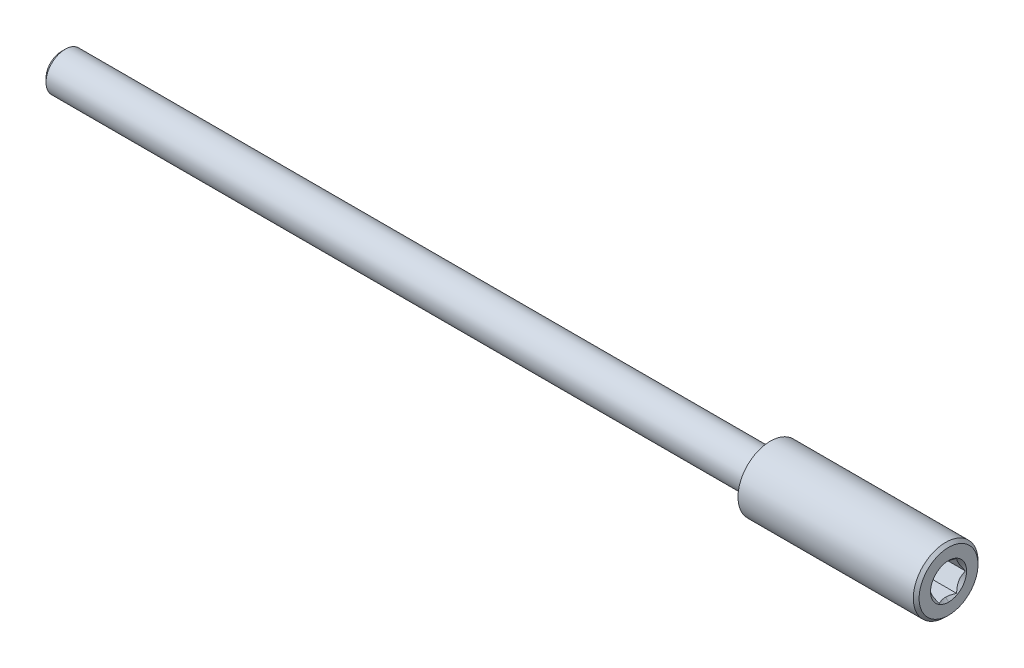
ISO-10303-21;
HEADER;
FILE_DESCRIPTION(('STEP AP214'),'2;1');
FILE_NAME('part.step','',(''),(''),'','','');
FILE_SCHEMA(('AUTOMOTIVE_DESIGN { 1 0 10303 214 1 1 1 1 }'));
ENDSEC;
DATA;
#1=APPLICATION_CONTEXT('core data for automotive mechanical design processes');
#2=APPLICATION_PROTOCOL_DEFINITION('international standard','automotive_design',2000,#1);
#3=PRODUCT_CONTEXT('',#1,'mechanical');
#4=PRODUCT('Part','Part','',(#3));
#5=PRODUCT_RELATED_PRODUCT_CATEGORY('part','',(#4));
#6=PRODUCT_DEFINITION_FORMATION('','',#4);
#7=PRODUCT_DEFINITION_CONTEXT('part definition',#1,'design');
#8=PRODUCT_DEFINITION('design','',#6,#7);
#9=PRODUCT_DEFINITION_SHAPE('','',#8);
#10=(LENGTH_UNIT() NAMED_UNIT(*) SI_UNIT(.MILLI.,.METRE.));
#11=(NAMED_UNIT(*) PLANE_ANGLE_UNIT() SI_UNIT($,.RADIAN.));
#12=(NAMED_UNIT(*) SI_UNIT($,.STERADIAN.) SOLID_ANGLE_UNIT());
#13=UNCERTAINTY_MEASURE_WITH_UNIT(LENGTH_MEASURE(1.E-05),#10,'distance_accuracy_value','');
#14=(GEOMETRIC_REPRESENTATION_CONTEXT(3) GLOBAL_UNCERTAINTY_ASSIGNED_CONTEXT((#13)) GLOBAL_UNIT_ASSIGNED_CONTEXT((#10,
#11,#12)) REPRESENTATION_CONTEXT('',''));
#15=CARTESIAN_POINT('',(0.,0.,0.));
#16=DIRECTION('',(0.,0.,1.));
#17=DIRECTION('',(1.,0.,0.));
#18=AXIS2_PLACEMENT_3D('',#15,#16,#17);
#19=CARTESIAN_POINT('',(218.5,0.,0.));
#20=DIRECTION('',(1.,0.,0.));
#21=DIRECTION('',(0.,0.,-1.));
#22=AXIS2_PLACEMENT_3D('',#19,#20,#21);
#23=PLANE('',#22);
#24=DIRECTION('',(0.,0.,1.));
#25=VECTOR('',#24,1.);
#26=CARTESIAN_POINT('',(218.5,3.897114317,0.));
#27=LINE('',#26,#25);
#28=CARTESIAN_POINT('',(218.5,3.89711431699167,-2.24999999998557));
#29=VERTEX_POINT('',#28);
#30=CARTESIAN_POINT('',(218.5,3.89711431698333,2.24999999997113));
#31=VERTEX_POINT('',#30);
#32=EDGE_CURVE('E202',#29,#31,#27,.T.);
#33=ORIENTED_EDGE('',*,*,#32,.T.);
#34=DIRECTION('',(0.,-0.866025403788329,0.499999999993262));
#35=VECTOR('',#34,1.);
#36=CARTESIAN_POINT('',(218.5,1.94855715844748,3.37499999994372));
#37=LINE('',#36,#35);
#38=CARTESIAN_POINT('',(218.5,-1.01017971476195E-10,4.49999999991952));
#39=VERTEX_POINT('',#38);
#40=EDGE_CURVE('E190',#31,#39,#37,.T.);
#41=ORIENTED_EDGE('',*,*,#40,.T.);
#42=DIRECTION('',(0.,-0.866025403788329,-0.499999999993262));
#43=VECTOR('',#42,1.);
#44=CARTESIAN_POINT('',(218.5,-1.94855715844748,3.37499999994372));
#45=LINE('',#44,#43);
#46=CARTESIAN_POINT('',(218.5,-3.89711431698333,2.2499999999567));
#47=VERTEX_POINT('',#46);
#48=EDGE_CURVE('E195',#39,#47,#45,.T.);
#49=ORIENTED_EDGE('',*,*,#48,.T.);
#50=DIRECTION('',(0.,0.,-1.));
#51=VECTOR('',#50,1.);
#52=CARTESIAN_POINT('',(218.5,-3.897114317,0.));
#53=LINE('',#52,#51);
#54=CARTESIAN_POINT('',(218.5,-3.89711431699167,-2.24999999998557));
#55=VERTEX_POINT('',#54);
#56=EDGE_CURVE('E198',#47,#55,#53,.T.);
#57=ORIENTED_EDGE('',*,*,#56,.T.);
#58=DIRECTION('',(0.,0.866025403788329,-0.499999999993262));
#59=VECTOR('',#58,1.);
#60=CARTESIAN_POINT('',(218.5,-1.94855715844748,-3.37499999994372));
#61=LINE('',#60,#59);
#62=CARTESIAN_POINT('',(218.5,4.04069500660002E-11,-4.49999999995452));
#63=VERTEX_POINT('',#62);
#64=EDGE_CURVE('E206',#55,#63,#61,.T.);
#65=ORIENTED_EDGE('',*,*,#64,.T.);
#66=DIRECTION('',(0.,0.866025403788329,0.499999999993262));
#67=VECTOR('',#66,1.);
#68=CARTESIAN_POINT('',(218.5,1.94855715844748,-3.37499999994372));
#69=LINE('',#68,#67);
#70=EDGE_CURVE('E217',#63,#29,#69,.T.);
#71=ORIENTED_EDGE('',*,*,#70,.T.);
#72=EDGE_LOOP('',(#33,#41,#49,#57,#65,#71));
#73=FACE_BOUND('',#72,.T.);
#74=ADVANCED_FACE('F16',(#73),#23,.T.);
#75=CARTESIAN_POINT('',(0.,1.94855715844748,-3.37499999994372));
#76=DIRECTION('',(0.,0.499999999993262,-0.866025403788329));
#77=DIRECTION('',(0.,0.866025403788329,0.499999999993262));
#78=AXIS2_PLACEMENT_3D('',#75,#76,#77);
#79=PLANE('',#78);
#80=CARTESIAN_POINT('',(228.852885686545,3.89711432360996,-2.2499999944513));
#81=CARTESIAN_POINT('',(228.814459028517,3.83054783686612,-2.28843217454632));
#82=CARTESIAN_POINT('',(228.777204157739,3.76347272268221,-2.32715801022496));
#83=CARTESIAN_POINT('',(228.705391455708,3.62820637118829,-2.40525407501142));
#84=CARTESIAN_POINT('',(228.670835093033,3.56001455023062,-2.44462464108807));
#85=CARTESIAN_POINT('',(228.571409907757,3.35290072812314,-2.56420186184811));
#86=CARTESIAN_POINT('',(228.511254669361,3.21223650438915,-2.64541438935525));
#87=CARTESIAN_POINT('',(228.407413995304,2.92681055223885,-2.81020513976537));
#88=CARTESIAN_POINT('',(228.36367281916,2.78206451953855,-2.89377430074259));
#89=CARTESIAN_POINT('',(228.313106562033,2.5625850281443,-3.02049084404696));
#90=CARTESIAN_POINT('',(228.298767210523,2.48912416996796,-3.06290349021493));
#91=CARTESIAN_POINT('',(228.27542916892,2.34157694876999,-3.14808991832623));
#92=CARTESIAN_POINT('',(228.266428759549,2.26749079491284,-3.19086357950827));
#93=CARTESIAN_POINT('',(228.256827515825,2.15251574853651,-3.25724445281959));
#94=CARTESIAN_POINT('',(228.254269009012,2.11174316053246,-3.280784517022));
#95=CARTESIAN_POINT('',(228.250854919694,2.03016794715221,-3.32788198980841));
#96=CARTESIAN_POINT('',(228.249998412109,1.98936535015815,-3.35143938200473));
#97=CARTESIAN_POINT('',(228.250003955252,1.84613678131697,-3.43413243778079));
#98=CARTESIAN_POINT('',(228.255413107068,1.74368142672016,-3.49328506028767));
#99=CARTESIAN_POINT('',(228.276753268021,1.53955641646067,-3.6111366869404));
#100=CARTESIAN_POINT('',(228.292691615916,1.43788735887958,-3.66983534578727));
#101=CARTESIAN_POINT('',(228.334340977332,1.23559098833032,-3.7866312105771));
#102=CARTESIAN_POINT('',(228.360096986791,1.13497069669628,-3.84472436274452));
#103=CARTESIAN_POINT('',(228.420203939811,0.935665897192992,-3.95979304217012));
#104=CARTESIAN_POINT('',(228.45455810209,0.836982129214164,-4.0167681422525));
#105=CARTESIAN_POINT('',(228.542199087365,0.611943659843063,-4.14669416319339));
#106=CARTESIAN_POINT('',(228.598063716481,0.486343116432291,-4.21920967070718));
#107=CARTESIAN_POINT('',(228.688941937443,0.301289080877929,-4.32605066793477));
#108=CARTESIAN_POINT('',(228.720255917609,0.240432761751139,-4.36118608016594));
#109=CARTESIAN_POINT('',(228.785028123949,0.119582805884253,-4.4309588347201));
#110=CARTESIAN_POINT('',(228.818486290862,0.0595891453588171,-4.46559619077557));
#111=CARTESIAN_POINT('',(228.852885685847,-7.60819674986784E-09,-4.50000000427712));
#112=B_SPLINE_CURVE_WITH_KNOTS('',3,(#80,#81,#82,#83,#84,#85,#86,#87,#88,#89,#90,#91,#92,#93,
#94,#95,#96,#97,#98,#99,#100,#101,#102,#103,#104,#105,#106,#107,#108,#109,#110,#111),
.UNSPECIFIED.,.F.,.F.,(4,2,2,2,2,2,2,2,2,2,2,2,2,2,2,4),(0.,0.257789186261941,0.515717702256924,
1.03466403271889,1.55183177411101,1.80977788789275,2.06764089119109,2.20906162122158,
2.35040546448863,2.70515077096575,3.06014359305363,3.41678335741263,3.77355683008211,
4.23929667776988,4.47006709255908,4.70083113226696),.UNSPECIFIED.);
#113=CARTESIAN_POINT('',(228.852885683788,3.897114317,-2.25000000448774));
#114=VERTEX_POINT('',#113);
#115=CARTESIAN_POINT('',(228.852885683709,-3.78313352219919E-09,-4.50000000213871));
#116=VERTEX_POINT('',#115);
#117=EDGE_CURVE('E236',#114,#116,#112,.T.);
#118=ORIENTED_EDGE('',*,*,#117,.F.);
#119=DIRECTION('',(1.,0.,0.));
#120=VECTOR('',#119,1.);
#121=CARTESIAN_POINT('',(0.,3.897114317,-2.25));
#122=LINE('',#121,#120);
#123=EDGE_CURVE('E199',#114,#29,#122,.F.);
#124=ORIENTED_EDGE('',*,*,#123,.T.);
#125=ORIENTED_EDGE('',*,*,#70,.F.);
#126=DIRECTION('',(1.,0.,0.));
#127=VECTOR('',#126,1.);
#128=CARTESIAN_POINT('',(0.,1.2122204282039E-10,-4.49999999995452));
#129=LINE('',#128,#127);
#130=EDGE_CURVE('E203',#63,#116,#129,.T.);
#131=ORIENTED_EDGE('',*,*,#130,.T.);
#132=EDGE_LOOP('',(#118,#124,#125,#131));
#133=FACE_BOUND('',#132,.T.);
#134=ADVANCED_FACE('F235',(#133),#79,.F.);
#135=CARTESIAN_POINT('',(0.,-1.94855715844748,-3.37499999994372));
#136=DIRECTION('',(0.,-0.499999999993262,-0.866025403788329));
#137=DIRECTION('',(0.,0.866025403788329,-0.499999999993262));
#138=AXIS2_PLACEMENT_3D('',#135,#136,#137);
#139=PLANE('',#138);
#140=CARTESIAN_POINT('',(228.852885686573,8.18535243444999E-09,-4.50000000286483));
#141=CARTESIAN_POINT('',(228.814459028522,-0.0665664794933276,-4.46156782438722));
#142=CARTESIAN_POINT('',(228.777204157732,-0.133641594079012,-4.42284198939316));
#143=CARTESIAN_POINT('',(228.705391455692,-0.268907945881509,-4.34474592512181));
#144=CARTESIAN_POINT('',(228.670835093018,-0.337099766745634,-4.30537535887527));
#145=CARTESIAN_POINT('',(228.571409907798,-0.544213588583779,-4.18579813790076));
#146=CARTESIAN_POINT('',(228.51125466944,-0.684877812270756,-4.1045856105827));
#147=CARTESIAN_POINT('',(228.40741399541,-0.970303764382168,-3.93979486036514));
#148=CARTESIAN_POINT('',(228.363672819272,-1.11504979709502,-3.85622569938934));
#149=CARTESIAN_POINT('',(228.313106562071,-1.33452928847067,-3.72950915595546));
#150=CARTESIAN_POINT('',(228.298767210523,-1.40799014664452,-3.68709650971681));
#151=CARTESIAN_POINT('',(228.275429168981,-1.55553736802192,-3.60191008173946));
#152=CARTESIAN_POINT('',(228.266428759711,-1.62962352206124,-3.55913642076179));
#153=CARTESIAN_POINT('',(228.256827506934,-1.74459867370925,-3.49275548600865));
#154=CARTESIAN_POINT('',(228.254268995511,-1.78537136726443,-3.46921536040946));
#155=CARTESIAN_POINT('',(228.250854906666,-1.86694679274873,-3.42211776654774));
#156=CARTESIAN_POINT('',(228.249998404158,-1.90774949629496,-3.39856031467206));
#157=CARTESIAN_POINT('',(228.250003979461,-2.05097818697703,-3.31586719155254));
#158=CARTESIAN_POINT('',(228.255413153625,-2.1534335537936,-3.25671455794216));
#159=CARTESIAN_POINT('',(228.276753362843,-2.35755858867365,-3.13886291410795));
#160=CARTESIAN_POINT('',(228.292691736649,-2.45922765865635,-3.08016424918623));
#161=CARTESIAN_POINT('',(228.334341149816,-2.66152405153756,-2.96336837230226));
#162=CARTESIAN_POINT('',(228.360097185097,-2.76214435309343,-2.90527521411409));
#163=CARTESIAN_POINT('',(228.420204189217,-2.96144917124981,-2.79020652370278));
#164=CARTESIAN_POINT('',(228.45455837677,-3.06013294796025,-2.73323141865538));
#165=CARTESIAN_POINT('',(228.542199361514,-3.28517128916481,-2.60330547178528));
#166=CARTESIAN_POINT('',(228.598063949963,-3.41077169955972,-2.53079004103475));
#167=CARTESIAN_POINT('',(228.688942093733,-3.59582554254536,-2.42394915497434));
#168=CARTESIAN_POINT('',(228.720256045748,-3.65668179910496,-2.38881377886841));
#169=CARTESIAN_POINT('',(228.785028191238,-3.77753163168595,-2.31904109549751));
#170=CARTESIAN_POINT('',(228.818486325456,-3.83752523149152,-2.28440377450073));
#171=CARTESIAN_POINT('',(228.852885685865,-3.89711432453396,-2.24999999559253));
#172=B_SPLINE_CURVE_WITH_KNOTS('',3,(#140,#141,#142,#143,#144,#145,#146,#147,#148,#149,#150,
#151,#152,#153,#154,#155,#156,#157,#158,#159,#160,#161,#162,#163,#164,#165,#166,#167,#168,#169,
#170,#171),.UNSPECIFIED.,.F.,.F.,(4,2,2,2,2,2,2,2,2,2,2,2,2,2,2,4),(0.,0.257789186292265,
0.515717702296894,1.03466403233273,1.55183177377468,1.80977788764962,2.06764089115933,
2.20906198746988,2.35040619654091,2.70515155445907,3.06014442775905,3.41678424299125,
3.77355776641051,4.23929714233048,4.47006732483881,4.70083113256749),.UNSPECIFIED.);
#173=CARTESIAN_POINT('',(228.852885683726,-3.89711432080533,-2.24999999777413));
#174=VERTEX_POINT('',#173);
#175=EDGE_CURVE('E71',#116,#174,#172,.T.);
#176=ORIENTED_EDGE('',*,*,#175,.F.);
#177=ORIENTED_EDGE('',*,*,#130,.F.);
#178=ORIENTED_EDGE('',*,*,#64,.F.);
#179=DIRECTION('',(1.,0.,0.));
#180=VECTOR('',#179,1.);
#181=CARTESIAN_POINT('',(0.,-3.897114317,-2.25));
#182=LINE('',#181,#180);
#183=EDGE_CURVE('E196',#55,#174,#182,.T.);
#184=ORIENTED_EDGE('',*,*,#183,.T.);
#185=EDGE_LOOP('',(#176,#177,#178,#184));
#186=FACE_BOUND('',#185,.T.);
#187=ADVANCED_FACE('F250',(#186),#139,.F.);
#188=CARTESIAN_POINT('',(0.,3.897114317,0.));
#189=DIRECTION('',(0.,1.,0.));
#190=DIRECTION('',(0.,0.,1.));
#191=AXIS2_PLACEMENT_3D('',#188,#189,#190);
#192=PLANE('',#191);
#193=CARTESIAN_POINT('',(228.852885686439,3.89711431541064,2.25000000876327));
#194=CARTESIAN_POINT('',(228.813958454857,3.89711431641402,2.17213096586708));
#195=CARTESIAN_POINT('',(228.776233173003,3.89711431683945,2.09366305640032));
#196=CARTESIAN_POINT('',(228.703554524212,3.89711431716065,1.93540168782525));
#197=CARTESIAN_POINT('',(228.668602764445,3.89711431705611,1.85560749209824));
#198=CARTESIAN_POINT('',(228.568131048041,3.89711431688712,1.61322638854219));
#199=CARTESIAN_POINT('',(228.507465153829,3.89711431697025,1.44856115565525));
#200=CARTESIAN_POINT('',(228.404469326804,3.89711431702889,1.11875969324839));
#201=CARTESIAN_POINT('',(228.361657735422,3.89711431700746,0.953776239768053));
#202=CARTESIAN_POINT('',(228.295690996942,3.89711431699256,0.620258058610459));
#203=CARTESIAN_POINT('',(228.272475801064,3.897114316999,0.451735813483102));
#204=CARTESIAN_POINT('',(228.256831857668,3.89711431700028,0.235613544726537));
#205=CARTESIAN_POINT('',(228.25427892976,3.89711431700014,0.188641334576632));
#206=CARTESIAN_POINT('',(228.2508603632,3.89711431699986,0.0944492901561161));
#207=CARTESIAN_POINT('',(228.250001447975,3.89711431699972,0.047229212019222));
#208=CARTESIAN_POINT('',(228.249999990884,3.897114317,-1.67119599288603E-11));
#209=B_SPLINE_CURVE_WITH_KNOTS('',3,(#193,#194,#195,#196,#197,#198,#199,#200,#201,#202,#203,
#204,#205,#206,#207,#208),.UNSPECIFIED.,.F.,.F.,(4,2,2,2,2,2,2,4),(0.,0.261149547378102,
0.522449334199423,1.04814184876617,1.55855607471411,2.06740051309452,2.20850337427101,
2.35016514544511),.UNSPECIFIED.);
#210=CARTESIAN_POINT('',(228.852885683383,3.89711432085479,2.2499999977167));
#211=VERTEX_POINT('',#210);
#212=CARTESIAN_POINT('',(228.249999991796,3.897114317,0.));
#213=VERTEX_POINT('',#212);
#214=EDGE_CURVE('E104',#211,#213,#209,.T.);
#215=ORIENTED_EDGE('',*,*,#214,.F.);
#216=DIRECTION('',(1.,0.,0.));
#217=VECTOR('',#216,1.);
#218=CARTESIAN_POINT('',(0.,3.897114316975,2.2499999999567));
#219=LINE('',#218,#217);
#220=EDGE_CURVE('E191',#211,#31,#219,.F.);
#221=ORIENTED_EDGE('',*,*,#220,.T.);
#222=ORIENTED_EDGE('',*,*,#32,.F.);
#223=ORIENTED_EDGE('',*,*,#123,.F.);
#224=CARTESIAN_POINT('',(228.249999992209,3.89711431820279,0.));
#225=CARTESIAN_POINT('',(228.249995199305,3.89711431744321,-0.0598554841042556));
#226=CARTESIAN_POINT('',(228.25137965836,3.89711431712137,-0.119702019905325));
#227=CARTESIAN_POINT('',(228.256881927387,3.89711431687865,-0.239260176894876));
#228=CARTESIAN_POINT('',(228.260999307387,3.8971143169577,-0.298971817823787));
#229=CARTESIAN_POINT('',(228.277362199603,3.89711431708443,-0.477521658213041));
#230=CARTESIAN_POINT('',(228.293618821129,3.89711431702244,-0.596012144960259));
#231=CARTESIAN_POINT('',(228.335649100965,3.8971143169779,-0.829400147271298));
#232=CARTESIAN_POINT('',(228.36127552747,3.89711431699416,-0.944324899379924));
#233=CARTESIAN_POINT('',(228.420930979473,3.89711431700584,-1.17199378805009));
#234=CARTESIAN_POINT('',(228.454962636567,3.89711431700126,-1.28473722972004));
#235=CARTESIAN_POINT('',(228.517151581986,3.89711431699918,-1.46912247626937));
#236=CARTESIAN_POINT('',(228.54325829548,3.89711431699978,-1.54146950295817));
#237=CARTESIAN_POINT('',(228.598197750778,3.89711431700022,-1.68510393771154));
#238=CARTESIAN_POINT('',(228.627029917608,3.89711431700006,-1.75639156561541));
#239=CARTESIAN_POINT('',(228.687425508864,3.89711431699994,-1.89866546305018));
#240=CARTESIAN_POINT('',(228.71901409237,3.89711431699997,-1.96964099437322));
#241=CARTESIAN_POINT('',(228.78437899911,3.89711431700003,-2.11057322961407));
#242=CARTESIAN_POINT('',(228.818155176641,3.89711431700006,-2.18053000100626));
#243=CARTESIAN_POINT('',(228.852885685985,3.897114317,-2.25000000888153));
#244=B_SPLINE_CURVE_WITH_KNOTS('',3,(#224,#225,#226,#227,#228,#229,#230,#231,#232,#233,#234,
#235,#236,#237,#238,#239,#240,#241,#242,#243),.UNSPECIFIED.,.F.,.F.,(4,2,2,2,2,2,2,2,2,4),(0.,
0.179533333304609,0.359038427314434,0.717339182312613,1.07023611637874,1.42324367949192,
1.65393160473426,1.88457097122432,2.11759520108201,2.35060392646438),.UNSPECIFIED.);
#245=EDGE_CURVE('E76',#213,#114,#244,.T.);
#246=ORIENTED_EDGE('',*,*,#245,.F.);
#247=EDGE_LOOP('',(#215,#221,#222,#223,#246));
#248=FACE_BOUND('',#247,.T.);
#249=ADVANCED_FACE('F138',(#248),#192,.F.);
#250=CARTESIAN_POINT('',(0.,-3.897114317,0.));
#251=DIRECTION('',(0.,-1.,0.));
#252=DIRECTION('',(0.,0.,-1.));
#253=AXIS2_PLACEMENT_3D('',#250,#251,#252);
#254=PLANE('',#253);
#255=CARTESIAN_POINT('',(228.852885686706,-3.89711431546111,-2.25000000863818));
#256=CARTESIAN_POINT('',(228.813958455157,-3.89711431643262,-2.17213096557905));
#257=CARTESIAN_POINT('',(228.77623317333,-3.89711431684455,-2.09366305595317));
#258=CARTESIAN_POINT('',(228.703554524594,-3.89711431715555,-1.93540168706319));
#259=CARTESIAN_POINT('',(228.668602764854,-3.89711431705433,-1.8556074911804));
#260=CARTESIAN_POINT('',(228.568131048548,-3.8971143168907,-1.61322638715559));
#261=CARTESIAN_POINT('',(228.507465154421,-3.89711431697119,-1.4485611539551));
#262=CARTESIAN_POINT('',(228.404469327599,-3.89711431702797,-1.11875969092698));
#263=CARTESIAN_POINT('',(228.361657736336,-3.89711431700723,-0.953776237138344));
#264=CARTESIAN_POINT('',(228.295690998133,-3.8971143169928,-0.620258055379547));
#265=CARTESIAN_POINT('',(228.272475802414,-3.89711431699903,-0.451735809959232));
#266=CARTESIAN_POINT('',(228.25683185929,-3.89711431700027,-0.235613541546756));
#267=CARTESIAN_POINT('',(228.254278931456,-3.89711431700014,-0.188641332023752));
#268=CARTESIAN_POINT('',(228.250860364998,-3.89711431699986,-0.0944492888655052));
#269=CARTESIAN_POINT('',(228.250001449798,-3.89711431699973,-0.0472292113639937));
#270=CARTESIAN_POINT('',(228.249999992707,-3.897114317,3.63348311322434E-11));
#271=B_SPLINE_CURVE_WITH_KNOTS('',3,(#255,#256,#257,#258,#259,#260,#261,#262,#263,#264,#265,
#266,#267,#268,#269,#270),.UNSPECIFIED.,.F.,.F.,(4,2,2,2,2,2,2,4),(0.,0.261149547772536,
0.522449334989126,1.04814185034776,1.55855607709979,2.06740051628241,2.20850337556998,
2.35016514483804),.UNSPECIFIED.);
#272=CARTESIAN_POINT('',(228.249999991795,-3.897114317,1.46484637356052E-13));
#273=VERTEX_POINT('',#272);
#274=EDGE_CURVE('E19',#174,#273,#271,.T.);
#275=ORIENTED_EDGE('',*,*,#274,.F.);
#276=ORIENTED_EDGE('',*,*,#183,.F.);
#277=ORIENTED_EDGE('',*,*,#56,.F.);
#278=DIRECTION('',(1.,0.,0.));
#279=VECTOR('',#278,1.);
#280=CARTESIAN_POINT('',(0.,-3.897114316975,2.2499999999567));
#281=LINE('',#280,#279);
#282=CARTESIAN_POINT('',(228.852885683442,-3.8971143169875,2.25000000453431));
#283=VERTEX_POINT('',#282);
#284=EDGE_CURVE('E89',#47,#283,#281,.T.);
#285=ORIENTED_EDGE('',*,*,#284,.T.);
#286=CARTESIAN_POINT('',(228.249999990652,-3.89711431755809,3.09368730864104E-13));
#287=CARTESIAN_POINT('',(228.249995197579,-3.89711431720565,0.0598554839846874));
#288=CARTESIAN_POINT('',(228.251379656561,-3.89711431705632,0.119702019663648));
#289=CARTESIAN_POINT('',(228.256881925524,-3.89711431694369,0.239260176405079));
#290=CARTESIAN_POINT('',(228.260999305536,-3.89711431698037,0.298971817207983));
#291=CARTESIAN_POINT('',(228.277362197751,-3.89711431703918,0.47752165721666));
#292=CARTESIAN_POINT('',(228.293618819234,-3.89711431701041,0.59601214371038));
#293=CARTESIAN_POINT('',(228.335649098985,-3.89711431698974,0.829400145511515));
#294=CARTESIAN_POINT('',(228.361275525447,-3.89711431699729,0.944324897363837));
#295=CARTESIAN_POINT('',(228.420930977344,-3.89711431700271,1.17199378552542));
#296=CARTESIAN_POINT('',(228.454962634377,-3.89711431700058,1.28473722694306));
#297=CARTESIAN_POINT('',(228.517151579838,-3.89711431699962,1.46912247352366));
#298=CARTESIAN_POINT('',(228.543258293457,-3.8971143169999,1.54146950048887));
#299=CARTESIAN_POINT('',(228.598197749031,-3.8971143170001,1.68510393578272));
#300=CARTESIAN_POINT('',(228.627029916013,-3.89711431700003,1.75639156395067));
#301=CARTESIAN_POINT('',(228.687425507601,-3.89711431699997,1.89866546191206));
#302=CARTESIAN_POINT('',(228.719014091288,-3.89711431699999,1.9696409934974));
#303=CARTESIAN_POINT('',(228.784378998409,-3.89711431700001,2.11057322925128));
#304=CARTESIAN_POINT('',(228.818155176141,-3.89711431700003,2.18053000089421));
#305=CARTESIAN_POINT('',(228.852885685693,-3.897114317,2.25000000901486));
#306=B_SPLINE_CURVE_WITH_KNOTS('',3,(#286,#287,#288,#289,#290,#291,#292,#293,#294,#295,#296,
#297,#298,#299,#300,#301,#302,#303,#304,#305),.UNSPECIFIED.,.F.,.F.,(4,2,2,2,2,2,2,2,2,4),(0.,
0.179533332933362,0.359038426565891,0.717339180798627,1.07023611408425,1.42324367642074,
1.65393160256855,1.88457096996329,2.11759520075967,2.35060392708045),.UNSPECIFIED.);
#307=EDGE_CURVE('E81',#273,#283,#306,.T.);
#308=ORIENTED_EDGE('',*,*,#307,.F.);
#309=EDGE_LOOP('',(#275,#276,#277,#285,#308));
#310=FACE_BOUND('',#309,.T.);
#311=ADVANCED_FACE('F86',(#310),#254,.F.);
#312=CARTESIAN_POINT('',(0.,-1.94855715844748,3.37499999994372));
#313=DIRECTION('',(0.,-0.499999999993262,0.866025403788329));
#314=DIRECTION('',(0.,-0.866025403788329,-0.499999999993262));
#315=AXIS2_PLACEMENT_3D('',#312,#313,#314);
#316=PLANE('',#315);
#317=CARTESIAN_POINT('',(228.852885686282,-3.89711432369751,2.24999999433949));
#318=CARTESIAN_POINT('',(228.814459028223,-3.83054783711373,2.2884321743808));
#319=CARTESIAN_POINT('',(228.777204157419,-3.7634727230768,2.32715800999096));
#320=CARTESIAN_POINT('',(228.705391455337,-3.62820637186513,2.40525407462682));
#321=CARTESIAN_POINT('',(228.670835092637,-3.56001455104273,2.44462464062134));
#322=CARTESIAN_POINT('',(228.571409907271,-3.35290072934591,2.56420186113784));
#323=CARTESIAN_POINT('',(228.511254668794,-3.21223650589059,2.64541438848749));
#324=CARTESIAN_POINT('',(228.407413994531,-2.92681055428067,2.81020513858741));
#325=CARTESIAN_POINT('',(228.363672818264,-2.78206452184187,2.89377429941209));
#326=CARTESIAN_POINT('',(228.313106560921,-2.56258503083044,3.02049084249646));
#327=CARTESIAN_POINT('',(228.298767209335,-2.48912417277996,3.06290348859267));
#328=CARTESIAN_POINT('',(228.27542916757,-2.34157695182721,3.14808991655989));
#329=CARTESIAN_POINT('',(228.266428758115,-2.26749079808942,3.19086357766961));
#330=CARTESIAN_POINT('',(228.256827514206,-2.15251575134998,3.25724445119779));
#331=CARTESIAN_POINT('',(228.254269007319,-2.11174316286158,3.28078451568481));
#332=CARTESIAN_POINT('',(228.250854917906,-2.03016794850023,3.3278819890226));
#333=CARTESIAN_POINT('',(228.249998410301,-1.98936535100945,3.35143938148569));
#334=CARTESIAN_POINT('',(228.250003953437,-1.846136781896,3.43413243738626));
#335=CARTESIAN_POINT('',(228.255413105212,-1.74368142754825,3.49328505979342));
#336=CARTESIAN_POINT('',(228.276753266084,-1.53955641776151,3.61113668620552));
#337=CARTESIAN_POINT('',(228.292691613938,-1.43788736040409,3.66983534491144));
#338=CARTESIAN_POINT('',(228.33434097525,-1.23559099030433,3.78663120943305));
#339=CARTESIAN_POINT('',(228.360096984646,-1.13497069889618,3.84472436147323));
#340=CARTESIAN_POINT('',(228.420203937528,-0.93566589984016,3.95979304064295));
#341=CARTESIAN_POINT('',(228.454558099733,-0.836982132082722,4.01676814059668));
#342=CARTESIAN_POINT('',(228.542199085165,-0.611943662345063,4.14669416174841));
#343=CARTESIAN_POINT('',(228.598063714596,-0.486343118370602,4.21920966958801));
#344=CARTESIAN_POINT('',(228.688941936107,-0.301289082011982,4.32605066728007));
#345=CARTESIAN_POINT('',(228.720255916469,-0.240432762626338,4.36118607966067));
#346=CARTESIAN_POINT('',(228.785028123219,-0.119582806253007,4.43095883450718));
#347=CARTESIAN_POINT('',(228.818486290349,-0.0595891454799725,4.46559619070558));
#348=CARTESIAN_POINT('',(228.852885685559,7.72983626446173E-09,4.50000000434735));
#349=B_SPLINE_CURVE_WITH_KNOTS('',3,(#317,#318,#319,#320,#321,#322,#323,#324,#325,#326,#327,
#328,#329,#330,#331,#332,#333,#334,#335,#336,#337,#338,#339,#340,#341,#342,#343,#344,#345,#346,
#347,#348),.UNSPECIFIED.,.F.,.F.,(4,2,2,2,2,2,2,2,2,2,2,2,2,2,2,4),(0.,0.257789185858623,
0.515717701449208,1.03466403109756,1.55183177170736,1.8097778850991,2.06764088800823,
2.20906161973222,2.35040546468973,2.7051507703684,3.06014359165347,3.41678335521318,
3.77355682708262,4.23929667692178,4.47006709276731,4.70083113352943),.UNSPECIFIED.);
#350=CARTESIAN_POINT('',(228.852885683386,3.84514177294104E-09,4.50000000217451));
#351=VERTEX_POINT('',#350);
#352=EDGE_CURVE('E90',#283,#351,#349,.T.);
#353=ORIENTED_EDGE('',*,*,#352,.F.);
#354=ORIENTED_EDGE('',*,*,#284,.F.);
#355=ORIENTED_EDGE('',*,*,#48,.F.);
#356=DIRECTION('',(1.,0.,0.));
#357=VECTOR('',#356,1.);
#358=CARTESIAN_POINT('',(0.,-1.2122204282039E-10,4.49999999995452));
#359=LINE('',#358,#357);
#360=EDGE_CURVE('E77',#39,#351,#359,.T.);
#361=ORIENTED_EDGE('',*,*,#360,.T.);
#362=EDGE_LOOP('',(#353,#354,#355,#361));
#363=FACE_BOUND('',#362,.T.);
#364=ADVANCED_FACE('F129',(#363),#316,.F.);
#365=CARTESIAN_POINT('',(0.,1.94855715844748,3.37499999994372));
#366=DIRECTION('',(0.,0.499999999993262,0.866025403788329));
#367=DIRECTION('',(0.,-0.866025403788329,0.499999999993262));
#368=AXIS2_PLACEMENT_3D('',#365,#366,#367);
#369=PLANE('',#368);
#370=CARTESIAN_POINT('',(228.852885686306,-8.32330037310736E-09,4.50000000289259));
#371=CARTESIAN_POINT('',(228.814459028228,0.0665664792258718,4.46156782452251));
#372=CARTESIAN_POINT('',(228.777204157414,0.13364159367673,4.42284198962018));
#373=CARTESIAN_POINT('',(228.705391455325,0.268907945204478,4.34474592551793));
#374=CARTESIAN_POINT('',(228.670835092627,0.337099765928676,4.30537535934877));
#375=CARTESIAN_POINT('',(228.571409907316,0.544213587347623,4.18579813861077));
#376=CARTESIAN_POINT('',(228.511254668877,0.684877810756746,4.10458561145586));
#377=CARTESIAN_POINT('',(228.407413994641,0.970303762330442,3.93979486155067));
#378=CARTESIAN_POINT('',(228.363672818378,1.11504979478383,3.85622570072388));
#379=CARTESIAN_POINT('',(228.313106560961,1.33452928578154,3.72950915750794));
#380=CARTESIAN_POINT('',(228.298767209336,1.40799014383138,3.68709651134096));
#381=CARTESIAN_POINT('',(228.275429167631,1.55553736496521,3.60191008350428));
#382=CARTESIAN_POINT('',(228.266428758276,1.62962351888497,3.55913642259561));
#383=CARTESIAN_POINT('',(228.256827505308,1.7445986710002,3.49275548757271));
#384=CARTESIAN_POINT('',(228.254268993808,1.78537136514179,3.46921536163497));
#385=CARTESIAN_POINT('',(228.250854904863,1.86694679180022,3.42211776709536));
#386=CARTESIAN_POINT('',(228.249998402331,1.90774949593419,3.39856031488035));
#387=CARTESIAN_POINT('',(228.250003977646,2.05097818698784,3.3158671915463));
#388=CARTESIAN_POINT('',(228.255413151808,2.15343355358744,3.25671455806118));
#389=CARTESIAN_POINT('',(228.276753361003,2.35755858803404,3.13886291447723));
#390=CARTESIAN_POINT('',(228.292691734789,2.45922765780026,3.08016424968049));
#391=CARTESIAN_POINT('',(228.334341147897,2.66152405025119,2.96336837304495));
#392=CARTESIAN_POINT('',(228.360097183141,2.76214435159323,2.90527521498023));
#393=CARTESIAN_POINT('',(228.420204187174,2.96144916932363,2.79020652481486));
#394=CARTESIAN_POINT('',(228.454558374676,3.06013294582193,2.73323141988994));
#395=CARTESIAN_POINT('',(228.542199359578,3.28517128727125,2.60330547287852));
#396=CARTESIAN_POINT('',(228.598063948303,3.4107716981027,2.53079004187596));
#397=CARTESIAN_POINT('',(228.688942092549,3.59582554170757,2.42394915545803));
#398=CARTESIAN_POINT('',(228.720256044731,3.65668179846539,2.38881377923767));
#399=CARTESIAN_POINT('',(228.785028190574,3.77753163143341,2.31904109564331));
#400=CARTESIAN_POINT('',(228.818486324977,3.83752523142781,2.28440377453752));
#401=CARTESIAN_POINT('',(228.852885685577,3.89711432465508,2.24999999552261));
#402=B_SPLINE_CURVE_WITH_KNOTS('',3,(#370,#371,#372,#373,#374,#375,#376,#377,#378,#379,#380,
#381,#382,#383,#384,#385,#386,#387,#388,#389,#390,#391,#392,#393,#394,#395,#396,#397,#398,#399,
#400,#401),.UNSPECIFIED.,.F.,.F.,(4,2,2,2,2,2,2,2,2,2,2,2,2,2,2,4),(0.,0.257789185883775,
0.515717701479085,1.03466403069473,1.55183177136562,1.80977788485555,2.06764088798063,
2.20906198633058,2.35040619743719,2.70515155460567,3.06014442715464,3.41678424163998,
3.77355776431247,4.23929714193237,4.47006732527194,4.70083113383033),.UNSPECIFIED.);
#403=EDGE_CURVE('E92',#351,#211,#402,.T.);
#404=ORIENTED_EDGE('',*,*,#403,.F.);
#405=ORIENTED_EDGE('',*,*,#360,.F.);
#406=ORIENTED_EDGE('',*,*,#40,.F.);
#407=ORIENTED_EDGE('',*,*,#220,.F.);
#408=EDGE_LOOP('',(#404,#405,#406,#407));
#409=FACE_BOUND('',#408,.T.);
#410=ADVANCED_FACE('F126',(#409),#369,.F.);
#411=CARTESIAN_POINT('',(228.245499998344,0.,0.));
#412=DIRECTION('',(1.,0.,0.));
#413=DIRECTION('',(0.,1.,0.));
#414=AXIS2_PLACEMENT_3D('',#411,#412,#413);
#415=CONICAL_SURFACE('',#414,3.89261432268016,0.785398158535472);
#416=ORIENTED_EDGE('',*,*,#117,.T.);
#417=ORIENTED_EDGE('',*,*,#175,.T.);
#418=ORIENTED_EDGE('',*,*,#274,.T.);
#419=DIRECTION('',(-0.707106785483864,0.707106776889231,0.));
#420=VECTOR('',#419,1.);
#421=CARTESIAN_POINT('',(228.588641,-4.23575532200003,0.));
#422=LINE('',#421,#420);
#423=CARTESIAN_POINT('',(229.,-4.64711431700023,9.37366345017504E-13));
#424=VERTEX_POINT('',#423);
#425=EDGE_CURVE('E68',#424,#273,#422,.T.);
#426=ORIENTED_EDGE('',*,*,#425,.F.);
#427=CARTESIAN_POINT('',(229.,0.,0.));
#428=DIRECTION('',(1.,0.,0.));
#429=DIRECTION('',(0.,1.,0.));
#430=AXIS2_PLACEMENT_3D('',#427,#428,#429);
#431=CIRCLE('',#430,4.64711431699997);
#432=CARTESIAN_POINT('',(229.,4.64711431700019,0.));
#433=VERTEX_POINT('',#432);
#434=EDGE_CURVE('E38',#433,#424,#431,.F.);
#435=ORIENTED_EDGE('',*,*,#434,.F.);
#436=DIRECTION('',(0.707106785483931,0.707106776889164,0.));
#437=VECTOR('',#436,1.);
#438=CARTESIAN_POINT('',(228.588641,4.235755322,0.));
#439=LINE('',#438,#437);
#440=EDGE_CURVE('E84',#213,#433,#439,.T.);
#441=ORIENTED_EDGE('',*,*,#440,.F.);
#442=ORIENTED_EDGE('',*,*,#245,.T.);
#443=EDGE_LOOP('',(#416,#417,#418,#426,#435,#441,#442));
#444=FACE_BOUND('',#443,.T.);
#445=ADVANCED_FACE('F67',(#444),#415,.F.);
#446=CARTESIAN_POINT('',(228.245499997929,0.,0.));
#447=DIRECTION('',(1.,0.,0.));
#448=DIRECTION('',(0.,1.,0.));
#449=AXIS2_PLACEMENT_3D('',#446,#447,#448);
#450=CONICAL_SURFACE('',#449,3.89261432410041,0.785398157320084);
#451=ORIENTED_EDGE('',*,*,#352,.T.);
#452=ORIENTED_EDGE('',*,*,#403,.T.);
#453=ORIENTED_EDGE('',*,*,#214,.T.);
#454=ORIENTED_EDGE('',*,*,#440,.T.);
#455=CARTESIAN_POINT('',(229.,0.,0.));
#456=DIRECTION('',(1.,0.,0.));
#457=DIRECTION('',(0.,1.,0.));
#458=AXIS2_PLACEMENT_3D('',#455,#456,#457);
#459=CIRCLE('',#458,4.64711431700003);
#460=EDGE_CURVE('E83',#424,#433,#459,.F.);
#461=ORIENTED_EDGE('',*,*,#460,.F.);
#462=ORIENTED_EDGE('',*,*,#425,.T.);
#463=ORIENTED_EDGE('',*,*,#307,.T.);
#464=EDGE_LOOP('',(#451,#452,#453,#454,#461,#462,#463));
#465=FACE_BOUND('',#464,.T.);
#466=ADVANCED_FACE('F80',(#465),#450,.F.);
#467=CARTESIAN_POINT('',(229.,0.,0.));
#468=DIRECTION('',(1.,0.,0.));
#469=DIRECTION('',(0.,0.,-1.));
#470=AXIS2_PLACEMENT_3D('',#467,#468,#469);
#471=PLANE('',#470);
#472=ORIENTED_EDGE('',*,*,#434,.T.);
#473=ORIENTED_EDGE('',*,*,#460,.T.);
#474=EDGE_LOOP('',(#472,#473));
#475=FACE_BOUND('',#474,.T.);
#476=CARTESIAN_POINT('',(229.000000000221,0.,0.));
#477=DIRECTION('',(-1.,0.,0.));
#478=DIRECTION('',(0.,-1.,0.));
#479=AXIS2_PLACEMENT_3D('',#476,#477,#478);
#480=CIRCLE('',#479,7.59999999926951);
#481=CARTESIAN_POINT('',(229.000000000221,-7.59999999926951,0.));
#482=VERTEX_POINT('',#481);
#483=EDGE_CURVE('E173',#482,#482,#480,.T.);
#484=ORIENTED_EDGE('',*,*,#483,.F.);
#485=EDGE_LOOP('',(#484));
#486=FACE_BOUND('',#485,.T.);
#487=ADVANCED_FACE('F114',(#475,#486),#471,.T.);
#488=CARTESIAN_POINT('',(0.,0.,0.));
#489=DIRECTION('',(1.,0.,0.));
#490=DIRECTION('',(0.,0.,-1.));
#491=AXIS2_PLACEMENT_3D('',#488,#489,#490);
#492=PLANE('',#491);
#493=CARTESIAN_POINT('',(-1.65821716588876E-10,0.,0.));
#494=DIRECTION('',(1.,0.,0.));
#495=DIRECTION('',(0.,1.,0.));
#496=AXIS2_PLACEMENT_3D('',#493,#494,#495);
#497=CIRCLE('',#496,3.94999999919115);
#498=CARTESIAN_POINT('',(-1.6586052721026E-10,3.94999999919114,0.));
#499=VERTEX_POINT('',#498);
#500=EDGE_CURVE('E171',#499,#499,#497,.F.);
#501=ORIENTED_EDGE('',*,*,#500,.T.);
#502=EDGE_LOOP('',(#501));
#503=FACE_BOUND('',#502,.T.);
#504=ADVANCED_FACE('F162',(#503),#492,.F.);
#505=CARTESIAN_POINT('',(229.,0.,0.));
#506=DIRECTION('',(-1.,0.,0.));
#507=DIRECTION('',(0.,-1.,0.));
#508=AXIS2_PLACEMENT_3D('',#505,#506,#507);
#509=CONICAL_SURFACE('',#508,7.59999999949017,0.785398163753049);
#510=CARTESIAN_POINT('',(228.25,0.,0.));
#511=DIRECTION('',(1.,0.,0.));
#512=DIRECTION('',(0.,0.87758256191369,0.479425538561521));
#513=AXIS2_PLACEMENT_3D('',#510,#511,#512);
#514=CIRCLE('',#513,8.35000000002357);
#515=CARTESIAN_POINT('',(228.25,7.327814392,4.003203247));
#516=VERTEX_POINT('',#515);
#517=EDGE_CURVE('E172',#516,#516,#514,.T.);
#518=ORIENTED_EDGE('',*,*,#517,.T.);
#519=EDGE_LOOP('',(#518));
#520=FACE_BOUND('',#519,.T.);
#521=ORIENTED_EDGE('',*,*,#483,.T.);
#522=EDGE_LOOP('',(#521));
#523=FACE_BOUND('',#522,.T.);
#524=ADVANCED_FACE('F159',(#520,#523),#509,.T.);
#525=CARTESIAN_POINT('',(0.,0.,0.));
#526=DIRECTION('',(1.,0.,0.));
#527=DIRECTION('',(0.,1.,0.));
#528=AXIS2_PLACEMENT_3D('',#525,#526,#527);
#529=CONICAL_SURFACE('',#528,3.94999999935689,0.785398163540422);
#530=ORIENTED_EDGE('',*,*,#500,.F.);
#531=EDGE_LOOP('',(#530));
#532=FACE_BOUND('',#531,.T.);
#533=CARTESIAN_POINT('',(1.,0.,0.));
#534=DIRECTION('',(1.,0.,0.));
#535=DIRECTION('',(0.,-0.877582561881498,-0.479425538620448));
#536=AXIS2_PLACEMENT_3D('',#533,#534,#535);
#537=CIRCLE('',#536,4.94999999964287);
#538=CARTESIAN_POINT('',(1.,-4.344033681,-2.373156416));
#539=VERTEX_POINT('',#538);
#540=EDGE_CURVE('E176',#539,#539,#537,.F.);
#541=ORIENTED_EDGE('',*,*,#540,.T.);
#542=EDGE_LOOP('',(#541));
#543=FACE_BOUND('',#542,.T.);
#544=ADVANCED_FACE('F155',(#532,#543),#529,.T.);
#545=CARTESIAN_POINT('',(183.,0.,0.));
#546=DIRECTION('',(1.,0.,0.));
#547=DIRECTION('',(0.,0.,-1.));
#548=AXIS2_PLACEMENT_3D('',#545,#546,#547);
#549=CYLINDRICAL_SURFACE('',#548,8.35000000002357);
#550=CARTESIAN_POINT('',(183.,0.,0.));
#551=DIRECTION('',(1.,0.,0.));
#552=DIRECTION('',(0.,0.,-1.));
#553=AXIS2_PLACEMENT_3D('',#550,#551,#552);
#554=CIRCLE('',#553,8.35000000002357);
#555=CARTESIAN_POINT('',(183.,0.,-8.35000000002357));
#556=VERTEX_POINT('',#555);
#557=EDGE_CURVE('E30',#556,#556,#554,.T.);
#558=ORIENTED_EDGE('',*,*,#557,.T.);
#559=EDGE_LOOP('',(#558));
#560=FACE_BOUND('',#559,.T.);
#561=ORIENTED_EDGE('',*,*,#517,.F.);
#562=EDGE_LOOP('',(#561));
#563=FACE_BOUND('',#562,.T.);
#564=ADVANCED_FACE('F147',(#560,#563),#549,.T.);
#565=CARTESIAN_POINT('',(1.,0.,0.));
#566=DIRECTION('',(1.,0.,0.));
#567=DIRECTION('',(0.,0.,-1.));
#568=AXIS2_PLACEMENT_3D('',#565,#566,#567);
#569=CYLINDRICAL_SURFACE('',#568,4.94999999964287);
#570=CARTESIAN_POINT('',(183.,0.,0.));
#571=DIRECTION('',(1.,0.,0.));
#572=DIRECTION('',(0.,0.,-1.));
#573=AXIS2_PLACEMENT_3D('',#570,#571,#572);
#574=CIRCLE('',#573,4.94999999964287);
#575=CARTESIAN_POINT('',(183.,0.,-4.94999999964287));
#576=VERTEX_POINT('',#575);
#577=EDGE_CURVE('E11',#576,#576,#574,.F.);
#578=ORIENTED_EDGE('',*,*,#577,.T.);
#579=EDGE_LOOP('',(#578));
#580=FACE_BOUND('',#579,.T.);
#581=ORIENTED_EDGE('',*,*,#540,.F.);
#582=EDGE_LOOP('',(#581));
#583=FACE_BOUND('',#582,.T.);
#584=ADVANCED_FACE('F141',(#580,#583),#569,.T.);
#585=CARTESIAN_POINT('',(183.,0.,0.));
#586=DIRECTION('',(1.,0.,0.));
#587=DIRECTION('',(0.,0.,-1.));
#588=AXIS2_PLACEMENT_3D('',#585,#586,#587);
#589=PLANE('',#588);
#590=ORIENTED_EDGE('',*,*,#577,.F.);
#591=EDGE_LOOP('',(#590));
#592=FACE_BOUND('',#591,.T.);
#593=ORIENTED_EDGE('',*,*,#557,.F.);
#594=EDGE_LOOP('',(#593));
#595=FACE_BOUND('',#594,.T.);
#596=ADVANCED_FACE('F139',(#592,#595),#589,.F.);
#597=CLOSED_SHELL('',(#74,#134,#187,#249,#311,#364,#410,#445,#466,#487,#504,#524,#544,#564,#584,#596));
#598=MANIFOLD_SOLID_BREP('B1',#597);
#599=ADVANCED_BREP_SHAPE_REPRESENTATION('',(#18,#598),#14);
#600=SHAPE_DEFINITION_REPRESENTATION(#9,#599);
ENDSEC;
END-ISO-10303-21;
